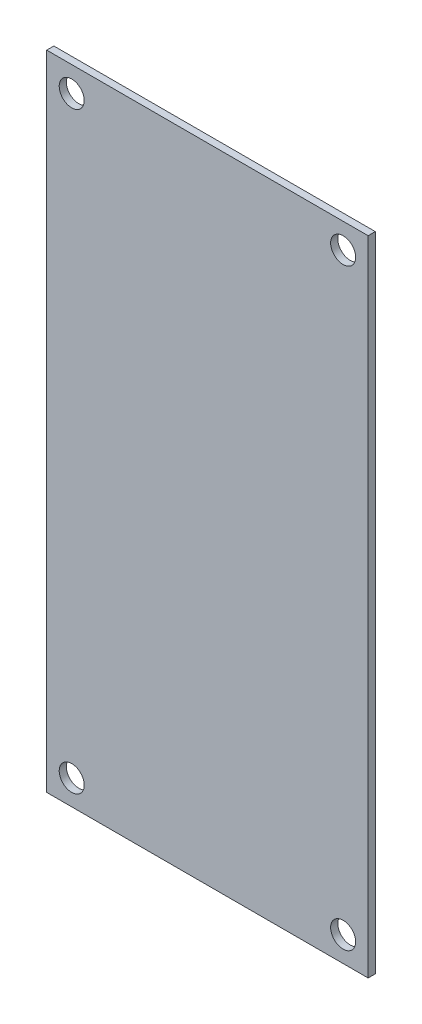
ISO-10303-21;
HEADER;
FILE_DESCRIPTION(('STEP AP214'),'2;1');
FILE_NAME('part.step','',(''),(''),'','','');
FILE_SCHEMA(('AUTOMOTIVE_DESIGN { 1 0 10303 214 1 1 1 1 }'));
ENDSEC;
DATA;
#1=APPLICATION_CONTEXT('core data for automotive mechanical design processes');
#2=APPLICATION_PROTOCOL_DEFINITION('international standard','automotive_design',2000,#1);
#3=PRODUCT_CONTEXT('',#1,'mechanical');
#4=PRODUCT('Part','Part','',(#3));
#5=PRODUCT_RELATED_PRODUCT_CATEGORY('part','',(#4));
#6=PRODUCT_DEFINITION_FORMATION('','',#4);
#7=PRODUCT_DEFINITION_CONTEXT('part definition',#1,'design');
#8=PRODUCT_DEFINITION('design','',#6,#7);
#9=PRODUCT_DEFINITION_SHAPE('','',#8);
#10=(LENGTH_UNIT() NAMED_UNIT(*) SI_UNIT(.MILLI.,.METRE.));
#11=(NAMED_UNIT(*) PLANE_ANGLE_UNIT() SI_UNIT($,.RADIAN.));
#12=(NAMED_UNIT(*) SI_UNIT($,.STERADIAN.) SOLID_ANGLE_UNIT());
#13=UNCERTAINTY_MEASURE_WITH_UNIT(LENGTH_MEASURE(1.E-05),#10,'distance_accuracy_value','');
#14=(GEOMETRIC_REPRESENTATION_CONTEXT(3) GLOBAL_UNCERTAINTY_ASSIGNED_CONTEXT((#13)) GLOBAL_UNIT_ASSIGNED_CONTEXT((#10,
#11,#12)) REPRESENTATION_CONTEXT('',''));
#15=CARTESIAN_POINT('',(0.,0.,0.));
#16=DIRECTION('',(0.,0.,1.));
#17=DIRECTION('',(1.,0.,0.));
#18=AXIS2_PLACEMENT_3D('',#15,#16,#17);
#19=CARTESIAN_POINT('',(45.,-90.,2.));
#20=DIRECTION('',(-1.,0.,0.));
#21=DIRECTION('',(0.,0.,1.));
#22=AXIS2_PLACEMENT_3D('',#19,#20,#21);
#23=PLANE('',#22);
#24=DIRECTION('',(0.,1.,0.));
#25=VECTOR('',#24,1.);
#26=CARTESIAN_POINT('',(45.,-90.,0.));
#27=LINE('',#26,#25);
#28=CARTESIAN_POINT('',(45.,-90.,0.));
#29=VERTEX_POINT('',#28);
#30=CARTESIAN_POINT('',(45.,90.,0.));
#31=VERTEX_POINT('',#30);
#32=EDGE_CURVE('E100',#29,#31,#27,.T.);
#33=ORIENTED_EDGE('',*,*,#32,.T.);
#34=DIRECTION('',(0.,0.,-1.));
#35=VECTOR('',#34,1.);
#36=CARTESIAN_POINT('',(45.,90.,2.));
#37=LINE('',#36,#35);
#38=CARTESIAN_POINT('',(45.,90.,2.));
#39=VERTEX_POINT('',#38);
#40=EDGE_CURVE('E11',#39,#31,#37,.T.);
#41=ORIENTED_EDGE('',*,*,#40,.F.);
#42=DIRECTION('',(0.,1.,0.));
#43=VECTOR('',#42,1.);
#44=CARTESIAN_POINT('',(45.,-90.,2.));
#45=LINE('',#44,#43);
#46=CARTESIAN_POINT('',(45.,-90.,2.));
#47=VERTEX_POINT('',#46);
#48=EDGE_CURVE('E88',#47,#39,#45,.T.);
#49=ORIENTED_EDGE('',*,*,#48,.F.);
#50=DIRECTION('',(0.,0.,-1.));
#51=VECTOR('',#50,1.);
#52=CARTESIAN_POINT('',(45.,-90.,2.));
#53=LINE('',#52,#51);
#54=EDGE_CURVE('E96',#47,#29,#53,.T.);
#55=ORIENTED_EDGE('',*,*,#54,.T.);
#56=EDGE_LOOP('',(#33,#41,#49,#55));
#57=FACE_BOUND('',#56,.T.);
#58=ADVANCED_FACE('F37',(#57),#23,.F.);
#59=CARTESIAN_POINT('',(-45.,90.,2.));
#60=DIRECTION('',(0.,-1.,0.));
#61=DIRECTION('',(0.,0.,-1.));
#62=AXIS2_PLACEMENT_3D('',#59,#60,#61);
#63=PLANE('',#62);
#64=DIRECTION('',(-1.,0.,0.));
#65=VECTOR('',#64,1.);
#66=CARTESIAN_POINT('',(-45.,90.,0.));
#67=LINE('',#66,#65);
#68=CARTESIAN_POINT('',(-45.,90.,0.));
#69=VERTEX_POINT('',#68);
#70=EDGE_CURVE('E92',#31,#69,#67,.T.);
#71=ORIENTED_EDGE('',*,*,#70,.T.);
#72=DIRECTION('',(0.,0.,-1.));
#73=VECTOR('',#72,1.);
#74=CARTESIAN_POINT('',(-45.,90.,2.));
#75=LINE('',#74,#73);
#76=CARTESIAN_POINT('',(-45.,90.,2.));
#77=VERTEX_POINT('',#76);
#78=EDGE_CURVE('E45',#77,#69,#75,.T.);
#79=ORIENTED_EDGE('',*,*,#78,.F.);
#80=DIRECTION('',(-1.,0.,0.));
#81=VECTOR('',#80,1.);
#82=CARTESIAN_POINT('',(-45.,90.,2.));
#83=LINE('',#82,#81);
#84=EDGE_CURVE('E83',#39,#77,#83,.T.);
#85=ORIENTED_EDGE('',*,*,#84,.F.);
#86=ORIENTED_EDGE('',*,*,#40,.T.);
#87=EDGE_LOOP('',(#71,#79,#85,#86));
#88=FACE_BOUND('',#87,.T.);
#89=ADVANCED_FACE('F91',(#88),#63,.F.);
#90=CARTESIAN_POINT('',(-45.,-90.,2.));
#91=DIRECTION('',(1.,0.,0.));
#92=DIRECTION('',(0.,0.,-1.));
#93=AXIS2_PLACEMENT_3D('',#90,#91,#92);
#94=PLANE('',#93);
#95=DIRECTION('',(0.,-1.,0.));
#96=VECTOR('',#95,1.);
#97=CARTESIAN_POINT('',(-45.,-90.,0.));
#98=LINE('',#97,#96);
#99=CARTESIAN_POINT('',(-45.,-90.,0.));
#100=VERTEX_POINT('',#99);
#101=EDGE_CURVE('E70',#69,#100,#98,.T.);
#102=ORIENTED_EDGE('',*,*,#101,.T.);
#103=DIRECTION('',(0.,0.,-1.));
#104=VECTOR('',#103,1.);
#105=CARTESIAN_POINT('',(-45.,-90.,2.));
#106=LINE('',#105,#104);
#107=CARTESIAN_POINT('',(-45.,-90.,2.));
#108=VERTEX_POINT('',#107);
#109=EDGE_CURVE('E93',#108,#100,#106,.T.);
#110=ORIENTED_EDGE('',*,*,#109,.F.);
#111=DIRECTION('',(0.,-1.,0.));
#112=VECTOR('',#111,1.);
#113=CARTESIAN_POINT('',(-45.,-90.,2.));
#114=LINE('',#113,#112);
#115=EDGE_CURVE('E86',#77,#108,#114,.T.);
#116=ORIENTED_EDGE('',*,*,#115,.F.);
#117=ORIENTED_EDGE('',*,*,#78,.T.);
#118=EDGE_LOOP('',(#102,#110,#116,#117));
#119=FACE_BOUND('',#118,.T.);
#120=ADVANCED_FACE('F94',(#119),#94,.F.);
#121=CARTESIAN_POINT('',(-45.,-90.,2.));
#122=DIRECTION('',(0.,1.,0.));
#123=DIRECTION('',(0.,0.,1.));
#124=AXIS2_PLACEMENT_3D('',#121,#122,#123);
#125=PLANE('',#124);
#126=DIRECTION('',(1.,0.,0.));
#127=VECTOR('',#126,1.);
#128=CARTESIAN_POINT('',(-45.,-90.,0.));
#129=LINE('',#128,#127);
#130=EDGE_CURVE('E76',#100,#29,#129,.T.);
#131=ORIENTED_EDGE('',*,*,#130,.T.);
#132=ORIENTED_EDGE('',*,*,#54,.F.);
#133=DIRECTION('',(1.,0.,0.));
#134=VECTOR('',#133,1.);
#135=CARTESIAN_POINT('',(-45.,-90.,2.));
#136=LINE('',#135,#134);
#137=EDGE_CURVE('E53',#108,#47,#136,.T.);
#138=ORIENTED_EDGE('',*,*,#137,.F.);
#139=ORIENTED_EDGE('',*,*,#109,.T.);
#140=EDGE_LOOP('',(#131,#132,#138,#139));
#141=FACE_BOUND('',#140,.T.);
#142=ADVANCED_FACE('F108',(#141),#125,.F.);
#143=CARTESIAN_POINT('',(0.,0.,2.));
#144=DIRECTION('',(0.,0.,-1.));
#145=DIRECTION('',(-1.,0.,0.));
#146=AXIS2_PLACEMENT_3D('',#143,#144,#145);
#147=PLANE('',#146);
#148=CARTESIAN_POINT('',(38.,-83.,2.));
#149=DIRECTION('',(0.,0.,-1.));
#150=DIRECTION('',(-1.,0.,0.));
#151=AXIS2_PLACEMENT_3D('',#148,#149,#150);
#152=CIRCLE('',#151,3.5);
#153=CARTESIAN_POINT('',(34.5,-83.,2.));
#154=VERTEX_POINT('',#153);
#155=EDGE_CURVE('E118',#154,#154,#152,.T.);
#156=ORIENTED_EDGE('',*,*,#155,.T.);
#157=EDGE_LOOP('',(#156));
#158=FACE_BOUND('',#157,.T.);
#159=CARTESIAN_POINT('',(-38.,-82.9999999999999,2.));
#160=DIRECTION('',(0.,0.,-1.));
#161=DIRECTION('',(1.,0.,0.));
#162=AXIS2_PLACEMENT_3D('',#159,#160,#161);
#163=CIRCLE('',#162,3.5);
#164=CARTESIAN_POINT('',(-34.5,-82.9999999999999,2.));
#165=VERTEX_POINT('',#164);
#166=EDGE_CURVE('E129',#165,#165,#163,.T.);
#167=ORIENTED_EDGE('',*,*,#166,.T.);
#168=EDGE_LOOP('',(#167));
#169=FACE_BOUND('',#168,.T.);
#170=CARTESIAN_POINT('',(38.,83.,2.));
#171=DIRECTION('',(0.,0.,-1.));
#172=DIRECTION('',(-1.,0.,0.));
#173=AXIS2_PLACEMENT_3D('',#170,#171,#172);
#174=CIRCLE('',#173,3.5);
#175=CARTESIAN_POINT('',(34.5,83.,2.));
#176=VERTEX_POINT('',#175);
#177=EDGE_CURVE('E103',#176,#176,#174,.T.);
#178=ORIENTED_EDGE('',*,*,#177,.T.);
#179=EDGE_LOOP('',(#178));
#180=FACE_BOUND('',#179,.T.);
#181=CARTESIAN_POINT('',(-38.,83.,2.));
#182=DIRECTION('',(0.,0.,-1.));
#183=DIRECTION('',(1.,0.,0.));
#184=AXIS2_PLACEMENT_3D('',#181,#182,#183);
#185=CIRCLE('',#184,3.5);
#186=CARTESIAN_POINT('',(-34.5,83.,2.));
#187=VERTEX_POINT('',#186);
#188=EDGE_CURVE('E117',#187,#187,#185,.T.);
#189=ORIENTED_EDGE('',*,*,#188,.T.);
#190=EDGE_LOOP('',(#189));
#191=FACE_BOUND('',#190,.T.);
#192=ORIENTED_EDGE('',*,*,#48,.T.);
#193=ORIENTED_EDGE('',*,*,#84,.T.);
#194=ORIENTED_EDGE('',*,*,#115,.T.);
#195=ORIENTED_EDGE('',*,*,#137,.T.);
#196=EDGE_LOOP('',(#192,#193,#194,#195));
#197=FACE_BOUND('',#196,.T.);
#198=ADVANCED_FACE('F84',(#158,#169,#180,#191,#197),#147,.F.);
#199=CARTESIAN_POINT('',(0.,0.,0.));
#200=DIRECTION('',(0.,0.,-1.));
#201=DIRECTION('',(-1.,0.,0.));
#202=AXIS2_PLACEMENT_3D('',#199,#200,#201);
#203=PLANE('',#202);
#204=CARTESIAN_POINT('',(38.,-83.,0.));
#205=DIRECTION('',(0.,0.,-1.));
#206=DIRECTION('',(-1.,0.,0.));
#207=AXIS2_PLACEMENT_3D('',#204,#205,#206);
#208=CIRCLE('',#207,3.5);
#209=CARTESIAN_POINT('',(34.5,-83.,0.));
#210=VERTEX_POINT('',#209);
#211=EDGE_CURVE('E132',#210,#210,#208,.T.);
#212=ORIENTED_EDGE('',*,*,#211,.F.);
#213=EDGE_LOOP('',(#212));
#214=FACE_BOUND('',#213,.T.);
#215=CARTESIAN_POINT('',(-38.,-82.9999999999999,0.));
#216=DIRECTION('',(0.,0.,-1.));
#217=DIRECTION('',(1.,0.,0.));
#218=AXIS2_PLACEMENT_3D('',#215,#216,#217);
#219=CIRCLE('',#218,3.5);
#220=CARTESIAN_POINT('',(-34.5,-82.9999999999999,0.));
#221=VERTEX_POINT('',#220);
#222=EDGE_CURVE('E126',#221,#221,#219,.T.);
#223=ORIENTED_EDGE('',*,*,#222,.F.);
#224=EDGE_LOOP('',(#223));
#225=FACE_BOUND('',#224,.T.);
#226=CARTESIAN_POINT('',(38.,83.,0.));
#227=DIRECTION('',(0.,0.,-1.));
#228=DIRECTION('',(-1.,0.,0.));
#229=AXIS2_PLACEMENT_3D('',#226,#227,#228);
#230=CIRCLE('',#229,3.5);
#231=CARTESIAN_POINT('',(34.5,83.,0.));
#232=VERTEX_POINT('',#231);
#233=EDGE_CURVE('E121',#232,#232,#230,.T.);
#234=ORIENTED_EDGE('',*,*,#233,.F.);
#235=EDGE_LOOP('',(#234));
#236=FACE_BOUND('',#235,.T.);
#237=CARTESIAN_POINT('',(-38.,83.,0.));
#238=DIRECTION('',(0.,0.,-1.));
#239=DIRECTION('',(1.,0.,0.));
#240=AXIS2_PLACEMENT_3D('',#237,#238,#239);
#241=CIRCLE('',#240,3.5);
#242=CARTESIAN_POINT('',(-34.5,83.,0.));
#243=VERTEX_POINT('',#242);
#244=EDGE_CURVE('E114',#243,#243,#241,.T.);
#245=ORIENTED_EDGE('',*,*,#244,.F.);
#246=EDGE_LOOP('',(#245));
#247=FACE_BOUND('',#246,.T.);
#248=ORIENTED_EDGE('',*,*,#32,.F.);
#249=ORIENTED_EDGE('',*,*,#130,.F.);
#250=ORIENTED_EDGE('',*,*,#101,.F.);
#251=ORIENTED_EDGE('',*,*,#70,.F.);
#252=EDGE_LOOP('',(#248,#249,#250,#251));
#253=FACE_BOUND('',#252,.T.);
#254=ADVANCED_FACE('F111',(#214,#225,#236,#247,#253),#203,.T.);
#255=CARTESIAN_POINT('',(-38.,83.,2.));
#256=DIRECTION('',(0.,0.,-1.));
#257=DIRECTION('',(-1.,0.,0.));
#258=AXIS2_PLACEMENT_3D('',#255,#256,#257);
#259=CYLINDRICAL_SURFACE('',#258,3.5);
#260=ORIENTED_EDGE('',*,*,#188,.F.);
#261=EDGE_LOOP('',(#260));
#262=FACE_BOUND('',#261,.T.);
#263=ORIENTED_EDGE('',*,*,#244,.T.);
#264=EDGE_LOOP('',(#263));
#265=FACE_BOUND('',#264,.T.);
#266=ADVANCED_FACE('F149',(#262,#265),#259,.F.);
#267=CARTESIAN_POINT('',(38.,83.,2.));
#268=DIRECTION('',(0.,0.,-1.));
#269=DIRECTION('',(-1.,0.,0.));
#270=AXIS2_PLACEMENT_3D('',#267,#268,#269);
#271=CYLINDRICAL_SURFACE('',#270,3.5);
#272=ORIENTED_EDGE('',*,*,#177,.F.);
#273=EDGE_LOOP('',(#272));
#274=FACE_BOUND('',#273,.T.);
#275=ORIENTED_EDGE('',*,*,#233,.T.);
#276=EDGE_LOOP('',(#275));
#277=FACE_BOUND('',#276,.T.);
#278=ADVANCED_FACE('F158',(#274,#277),#271,.F.);
#279=CARTESIAN_POINT('',(-38.,-82.9999999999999,2.));
#280=DIRECTION('',(0.,0.,-1.));
#281=DIRECTION('',(-1.,0.,0.));
#282=AXIS2_PLACEMENT_3D('',#279,#280,#281);
#283=CYLINDRICAL_SURFACE('',#282,3.5);
#284=ORIENTED_EDGE('',*,*,#166,.F.);
#285=EDGE_LOOP('',(#284));
#286=FACE_BOUND('',#285,.T.);
#287=ORIENTED_EDGE('',*,*,#222,.T.);
#288=EDGE_LOOP('',(#287));
#289=FACE_BOUND('',#288,.T.);
#290=ADVANCED_FACE('F143',(#286,#289),#283,.F.);
#291=CARTESIAN_POINT('',(38.,-83.,2.));
#292=DIRECTION('',(0.,0.,-1.));
#293=DIRECTION('',(-1.,0.,0.));
#294=AXIS2_PLACEMENT_3D('',#291,#292,#293);
#295=CYLINDRICAL_SURFACE('',#294,3.5);
#296=ORIENTED_EDGE('',*,*,#155,.F.);
#297=EDGE_LOOP('',(#296));
#298=FACE_BOUND('',#297,.T.);
#299=ORIENTED_EDGE('',*,*,#211,.T.);
#300=EDGE_LOOP('',(#299));
#301=FACE_BOUND('',#300,.T.);
#302=ADVANCED_FACE('F140',(#298,#301),#295,.F.);
#303=CLOSED_SHELL('',(#58,#89,#120,#142,#198,#254,#266,#278,#290,#302));
#304=MANIFOLD_SOLID_BREP('B2',#303);
#305=ADVANCED_BREP_SHAPE_REPRESENTATION('',(#18,#304),#14);
#306=SHAPE_DEFINITION_REPRESENTATION(#9,#305);
ENDSEC;
END-ISO-10303-21;
